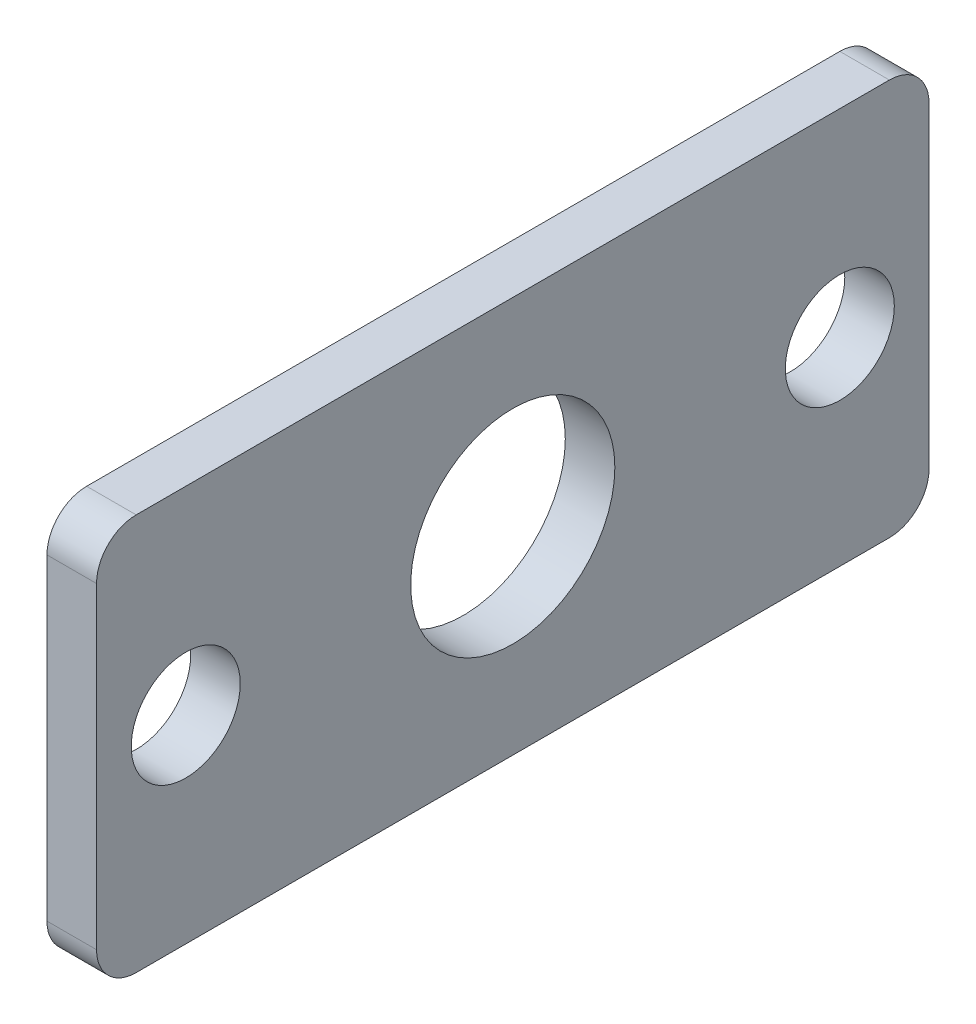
ISO-10303-21;
HEADER;
FILE_DESCRIPTION(('STEP AP214'),'2;1');
FILE_NAME('part.step','',(''),(''),'','','');
FILE_SCHEMA(('AUTOMOTIVE_DESIGN { 1 0 10303 214 1 1 1 1 }'));
ENDSEC;
DATA;
#1=APPLICATION_CONTEXT('core data for automotive mechanical design processes');
#2=APPLICATION_PROTOCOL_DEFINITION('international standard','automotive_design',2000,#1);
#3=PRODUCT_CONTEXT('',#1,'mechanical');
#4=PRODUCT('Part','Part','',(#3));
#5=PRODUCT_RELATED_PRODUCT_CATEGORY('part','',(#4));
#6=PRODUCT_DEFINITION_FORMATION('','',#4);
#7=PRODUCT_DEFINITION_CONTEXT('part definition',#1,'design');
#8=PRODUCT_DEFINITION('design','',#6,#7);
#9=PRODUCT_DEFINITION_SHAPE('','',#8);
#10=(LENGTH_UNIT() NAMED_UNIT(*) SI_UNIT(.MILLI.,.METRE.));
#11=(NAMED_UNIT(*) PLANE_ANGLE_UNIT() SI_UNIT($,.RADIAN.));
#12=(NAMED_UNIT(*) SI_UNIT($,.STERADIAN.) SOLID_ANGLE_UNIT());
#13=UNCERTAINTY_MEASURE_WITH_UNIT(LENGTH_MEASURE(1.E-05),#10,'distance_accuracy_value','');
#14=(GEOMETRIC_REPRESENTATION_CONTEXT(3) GLOBAL_UNCERTAINTY_ASSIGNED_CONTEXT((#13)) GLOBAL_UNIT_ASSIGNED_CONTEXT((#10,
#11,#12)) REPRESENTATION_CONTEXT('',''));
#15=CARTESIAN_POINT('',(0.,0.,0.));
#16=DIRECTION('',(0.,0.,1.));
#17=DIRECTION('',(1.,0.,0.));
#18=AXIS2_PLACEMENT_3D('',#15,#16,#17);
#19=CARTESIAN_POINT('',(2.5,1.99999999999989,-1.99999999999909));
#20=DIRECTION('',(1.,0.,0.));
#21=DIRECTION('',(0.,0.,-1.));
#22=AXIS2_PLACEMENT_3D('',#19,#20,#21);
#23=PLANE('',#22);
#24=CARTESIAN_POINT('',(2.5,9.99999999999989,-20.9999999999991));
#25=DIRECTION('',(1.,0.,0.));
#26=DIRECTION('',(0.,0.,-1.));
#27=AXIS2_PLACEMENT_3D('',#24,#25,#26);
#28=CIRCLE('',#27,5.15);
#29=CARTESIAN_POINT('',(2.5,9.99999999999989,-26.1499999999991));
#30=VERTEX_POINT('',#29);
#31=EDGE_CURVE('E190',#30,#30,#28,.T.);
#32=ORIENTED_EDGE('',*,*,#31,.F.);
#33=EDGE_LOOP('',(#32));
#34=FACE_BOUND('',#33,.T.);
#35=CARTESIAN_POINT('',(2.5,9.99999999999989,-37.4999999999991));
#36=DIRECTION('',(1.,0.,0.));
#37=DIRECTION('',(0.,0.,-1.));
#38=AXIS2_PLACEMENT_3D('',#35,#36,#37);
#39=CIRCLE('',#38,2.75);
#40=CARTESIAN_POINT('',(2.5,9.99999999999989,-40.2499999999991));
#41=VERTEX_POINT('',#40);
#42=EDGE_CURVE('E133',#41,#41,#39,.T.);
#43=ORIENTED_EDGE('',*,*,#42,.F.);
#44=EDGE_LOOP('',(#43));
#45=FACE_BOUND('',#44,.T.);
#46=CARTESIAN_POINT('',(2.5,1.99999999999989,-1.99999999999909));
#47=DIRECTION('',(1.,0.,0.));
#48=DIRECTION('',(0.,0.,-1.));
#49=AXIS2_PLACEMENT_3D('',#46,#47,#48);
#50=CIRCLE('',#49,2.);
#51=CARTESIAN_POINT('',(2.5,1.99999999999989,9.09494701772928E-13));
#52=VERTEX_POINT('',#51);
#53=CARTESIAN_POINT('',(2.5,-1.13686837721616E-13,-1.99999999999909));
#54=VERTEX_POINT('',#53);
#55=EDGE_CURVE('E144',#52,#54,#50,.T.);
#56=ORIENTED_EDGE('',*,*,#55,.T.);
#57=DIRECTION('',(0.,0.,-1.));
#58=VECTOR('',#57,1.);
#59=CARTESIAN_POINT('',(2.5,-1.13686837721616E-13,-1.99999999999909));
#60=LINE('',#59,#58);
#61=CARTESIAN_POINT('',(2.5,-1.14491749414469E-13,-39.9999999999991));
#62=VERTEX_POINT('',#61);
#63=EDGE_CURVE('E92',#54,#62,#60,.T.);
#64=ORIENTED_EDGE('',*,*,#63,.T.);
#65=CARTESIAN_POINT('',(2.5,1.99999999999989,-39.9999999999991));
#66=DIRECTION('',(1.,0.,0.));
#67=DIRECTION('',(0.,0.,-1.));
#68=AXIS2_PLACEMENT_3D('',#65,#66,#67);
#69=CIRCLE('',#68,2.);
#70=CARTESIAN_POINT('',(2.5,1.99999999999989,-41.9999999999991));
#71=VERTEX_POINT('',#70);
#72=EDGE_CURVE('E159',#62,#71,#69,.T.);
#73=ORIENTED_EDGE('',*,*,#72,.T.);
#74=DIRECTION('',(0.,1.,0.));
#75=VECTOR('',#74,1.);
#76=CARTESIAN_POINT('',(2.5,17.9999999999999,-41.9999999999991));
#77=LINE('',#76,#75);
#78=CARTESIAN_POINT('',(2.5,17.9999999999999,-41.9999999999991));
#79=VERTEX_POINT('',#78);
#80=EDGE_CURVE('E172',#71,#79,#77,.T.);
#81=ORIENTED_EDGE('',*,*,#80,.T.);
#82=CARTESIAN_POINT('',(2.5,17.9999999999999,-39.9999999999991));
#83=DIRECTION('',(1.,0.,0.));
#84=DIRECTION('',(0.,0.,-1.));
#85=AXIS2_PLACEMENT_3D('',#82,#83,#84);
#86=CIRCLE('',#85,2.);
#87=CARTESIAN_POINT('',(2.5,19.9999999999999,-39.9999999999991));
#88=VERTEX_POINT('',#87);
#89=EDGE_CURVE('E111',#79,#88,#86,.T.);
#90=ORIENTED_EDGE('',*,*,#89,.T.);
#91=DIRECTION('',(0.,0.,1.));
#92=VECTOR('',#91,1.);
#93=CARTESIAN_POINT('',(2.5,19.9999999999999,-1.99999999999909));
#94=LINE('',#93,#92);
#95=CARTESIAN_POINT('',(2.5,19.9999999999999,-1.99999999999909));
#96=VERTEX_POINT('',#95);
#97=EDGE_CURVE('E105',#88,#96,#94,.T.);
#98=ORIENTED_EDGE('',*,*,#97,.T.);
#99=CARTESIAN_POINT('',(2.5,17.9999999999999,-1.99999999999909));
#100=DIRECTION('',(1.,0.,0.));
#101=DIRECTION('',(0.,0.,-1.));
#102=AXIS2_PLACEMENT_3D('',#99,#100,#101);
#103=CIRCLE('',#102,2.);
#104=CARTESIAN_POINT('',(2.5,17.9999999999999,9.09494701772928E-13));
#105=VERTEX_POINT('',#104);
#106=EDGE_CURVE('E109',#96,#105,#103,.T.);
#107=ORIENTED_EDGE('',*,*,#106,.T.);
#108=DIRECTION('',(0.,-1.,0.));
#109=VECTOR('',#108,1.);
#110=CARTESIAN_POINT('',(2.5,17.9999999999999,9.09494701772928E-13));
#111=LINE('',#110,#109);
#112=EDGE_CURVE('E49',#105,#52,#111,.T.);
#113=ORIENTED_EDGE('',*,*,#112,.T.);
#114=EDGE_LOOP('',(#56,#64,#73,#81,#90,#98,#107,#113));
#115=FACE_BOUND('',#114,.T.);
#116=CARTESIAN_POINT('',(2.5,9.99999999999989,-4.49999999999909));
#117=DIRECTION('',(1.,0.,0.));
#118=DIRECTION('',(0.,0.,-1.));
#119=AXIS2_PLACEMENT_3D('',#116,#117,#118);
#120=CIRCLE('',#119,2.75);
#121=CARTESIAN_POINT('',(2.5,9.99999999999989,-7.24999999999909));
#122=VERTEX_POINT('',#121);
#123=EDGE_CURVE('E181',#122,#122,#120,.T.);
#124=ORIENTED_EDGE('',*,*,#123,.F.);
#125=EDGE_LOOP('',(#124));
#126=FACE_BOUND('',#125,.T.);
#127=ADVANCED_FACE('F32',(#34,#45,#115,#126),#23,.T.);
#128=CARTESIAN_POINT('',(0.,1.99999999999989,-1.99999999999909));
#129=DIRECTION('',(1.,0.,0.));
#130=DIRECTION('',(0.,0.,-1.));
#131=AXIS2_PLACEMENT_3D('',#128,#129,#130);
#132=PLANE('',#131);
#133=CARTESIAN_POINT('',(0.,9.99999999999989,-20.9999999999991));
#134=DIRECTION('',(1.,0.,0.));
#135=DIRECTION('',(0.,0.,-1.));
#136=AXIS2_PLACEMENT_3D('',#133,#134,#135);
#137=CIRCLE('',#136,5.15);
#138=CARTESIAN_POINT('',(0.,9.99999999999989,-26.1499999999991));
#139=VERTEX_POINT('',#138);
#140=EDGE_CURVE('E187',#139,#139,#137,.T.);
#141=ORIENTED_EDGE('',*,*,#140,.T.);
#142=EDGE_LOOP('',(#141));
#143=FACE_BOUND('',#142,.T.);
#144=CARTESIAN_POINT('',(0.,9.99999999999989,-37.4999999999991));
#145=DIRECTION('',(1.,0.,0.));
#146=DIRECTION('',(0.,0.,-1.));
#147=AXIS2_PLACEMENT_3D('',#144,#145,#146);
#148=CIRCLE('',#147,2.75);
#149=CARTESIAN_POINT('',(0.,9.99999999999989,-40.2499999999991));
#150=VERTEX_POINT('',#149);
#151=EDGE_CURVE('E178',#150,#150,#148,.T.);
#152=ORIENTED_EDGE('',*,*,#151,.T.);
#153=EDGE_LOOP('',(#152));
#154=FACE_BOUND('',#153,.T.);
#155=CARTESIAN_POINT('',(0.,1.99999999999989,-1.99999999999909));
#156=DIRECTION('',(1.,0.,0.));
#157=DIRECTION('',(0.,0.,-1.));
#158=AXIS2_PLACEMENT_3D('',#155,#156,#157);
#159=CIRCLE('',#158,2.);
#160=CARTESIAN_POINT('',(0.,1.99999999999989,9.09494701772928E-13));
#161=VERTEX_POINT('',#160);
#162=CARTESIAN_POINT('',(0.,-1.13686837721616E-13,-1.99999999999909));
#163=VERTEX_POINT('',#162);
#164=EDGE_CURVE('E129',#161,#163,#159,.T.);
#165=ORIENTED_EDGE('',*,*,#164,.F.);
#166=DIRECTION('',(0.,-1.,0.));
#167=VECTOR('',#166,1.);
#168=CARTESIAN_POINT('',(0.,17.9999999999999,9.09494701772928E-13));
#169=LINE('',#168,#167);
#170=CARTESIAN_POINT('',(0.,17.9999999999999,9.09494701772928E-13));
#171=VERTEX_POINT('',#170);
#172=EDGE_CURVE('E84',#171,#161,#169,.T.);
#173=ORIENTED_EDGE('',*,*,#172,.F.);
#174=CARTESIAN_POINT('',(0.,17.9999999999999,-1.99999999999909));
#175=DIRECTION('',(1.,0.,0.));
#176=DIRECTION('',(0.,0.,-1.));
#177=AXIS2_PLACEMENT_3D('',#174,#175,#176);
#178=CIRCLE('',#177,2.);
#179=CARTESIAN_POINT('',(0.,19.9999999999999,-1.99999999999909));
#180=VERTEX_POINT('',#179);
#181=EDGE_CURVE('E78',#180,#171,#178,.T.);
#182=ORIENTED_EDGE('',*,*,#181,.F.);
#183=DIRECTION('',(0.,0.,1.));
#184=VECTOR('',#183,1.);
#185=CARTESIAN_POINT('',(0.,19.9999999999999,-1.99999999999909));
#186=LINE('',#185,#184);
#187=CARTESIAN_POINT('',(0.,19.9999999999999,-39.9999999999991));
#188=VERTEX_POINT('',#187);
#189=EDGE_CURVE('E119',#188,#180,#186,.T.);
#190=ORIENTED_EDGE('',*,*,#189,.F.);
#191=CARTESIAN_POINT('',(0.,17.9999999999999,-39.9999999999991));
#192=DIRECTION('',(1.,0.,0.));
#193=DIRECTION('',(0.,0.,-1.));
#194=AXIS2_PLACEMENT_3D('',#191,#192,#193);
#195=CIRCLE('',#194,2.);
#196=CARTESIAN_POINT('',(0.,17.9999999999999,-41.9999999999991));
#197=VERTEX_POINT('',#196);
#198=EDGE_CURVE('E139',#197,#188,#195,.T.);
#199=ORIENTED_EDGE('',*,*,#198,.F.);
#200=DIRECTION('',(0.,1.,0.));
#201=VECTOR('',#200,1.);
#202=CARTESIAN_POINT('',(0.,17.9999999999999,-41.9999999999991));
#203=LINE('',#202,#201);
#204=CARTESIAN_POINT('',(0.,1.99999999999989,-41.9999999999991));
#205=VERTEX_POINT('',#204);
#206=EDGE_CURVE('E137',#205,#197,#203,.T.);
#207=ORIENTED_EDGE('',*,*,#206,.F.);
#208=CARTESIAN_POINT('',(0.,1.99999999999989,-39.9999999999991));
#209=DIRECTION('',(1.,0.,0.));
#210=DIRECTION('',(0.,0.,-1.));
#211=AXIS2_PLACEMENT_3D('',#208,#209,#210);
#212=CIRCLE('',#211,2.);
#213=CARTESIAN_POINT('',(0.,-1.14491749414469E-13,-39.9999999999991));
#214=VERTEX_POINT('',#213);
#215=EDGE_CURVE('E135',#214,#205,#212,.T.);
#216=ORIENTED_EDGE('',*,*,#215,.F.);
#217=DIRECTION('',(0.,0.,-1.));
#218=VECTOR('',#217,1.);
#219=CARTESIAN_POINT('',(0.,-1.13686837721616E-13,-1.99999999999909));
#220=LINE('',#219,#218);
#221=EDGE_CURVE('E132',#163,#214,#220,.T.);
#222=ORIENTED_EDGE('',*,*,#221,.F.);
#223=EDGE_LOOP('',(#165,#173,#182,#190,#199,#207,#216,#222));
#224=FACE_BOUND('',#223,.T.);
#225=CARTESIAN_POINT('',(0.,9.99999999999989,-4.49999999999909));
#226=DIRECTION('',(1.,0.,0.));
#227=DIRECTION('',(0.,0.,-1.));
#228=AXIS2_PLACEMENT_3D('',#225,#226,#227);
#229=CIRCLE('',#228,2.75);
#230=CARTESIAN_POINT('',(0.,9.99999999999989,-7.24999999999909));
#231=VERTEX_POINT('',#230);
#232=EDGE_CURVE('E184',#231,#231,#229,.T.);
#233=ORIENTED_EDGE('',*,*,#232,.T.);
#234=EDGE_LOOP('',(#233));
#235=FACE_BOUND('',#234,.T.);
#236=ADVANCED_FACE('F163',(#143,#154,#224,#235),#132,.F.);
#237=CARTESIAN_POINT('',(2.5,1.99999999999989,-1.99999999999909));
#238=DIRECTION('',(-1.,0.,0.));
#239=DIRECTION('',(0.,0.,1.));
#240=AXIS2_PLACEMENT_3D('',#237,#238,#239);
#241=CYLINDRICAL_SURFACE('',#240,2.);
#242=ORIENTED_EDGE('',*,*,#164,.T.);
#243=DIRECTION('',(-1.,0.,0.));
#244=VECTOR('',#243,1.);
#245=CARTESIAN_POINT('',(2.5,-1.13686837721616E-13,-1.99999999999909));
#246=LINE('',#245,#244);
#247=EDGE_CURVE('E11',#54,#163,#246,.T.);
#248=ORIENTED_EDGE('',*,*,#247,.F.);
#249=ORIENTED_EDGE('',*,*,#55,.F.);
#250=DIRECTION('',(-1.,0.,0.));
#251=VECTOR('',#250,1.);
#252=CARTESIAN_POINT('',(2.5,1.99999999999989,9.09494701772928E-13));
#253=LINE('',#252,#251);
#254=EDGE_CURVE('E125',#52,#161,#253,.T.);
#255=ORIENTED_EDGE('',*,*,#254,.T.);
#256=EDGE_LOOP('',(#242,#248,#249,#255));
#257=FACE_BOUND('',#256,.T.);
#258=ADVANCED_FACE('F34',(#257),#241,.T.);
#259=CARTESIAN_POINT('',(2.5,-1.13686837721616E-13,-1.99999999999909));
#260=DIRECTION('',(0.,1.,0.));
#261=DIRECTION('',(0.,0.,1.));
#262=AXIS2_PLACEMENT_3D('',#259,#260,#261);
#263=PLANE('',#262);
#264=ORIENTED_EDGE('',*,*,#221,.T.);
#265=DIRECTION('',(-1.,0.,0.));
#266=VECTOR('',#265,1.);
#267=CARTESIAN_POINT('',(2.5,-1.14491749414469E-13,-39.9999999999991));
#268=LINE('',#267,#266);
#269=EDGE_CURVE('E41',#62,#214,#268,.T.);
#270=ORIENTED_EDGE('',*,*,#269,.F.);
#271=ORIENTED_EDGE('',*,*,#63,.F.);
#272=ORIENTED_EDGE('',*,*,#247,.T.);
#273=EDGE_LOOP('',(#264,#270,#271,#272));
#274=FACE_BOUND('',#273,.T.);
#275=ADVANCED_FACE('F221',(#274),#263,.F.);
#276=CARTESIAN_POINT('',(2.5,1.99999999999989,-39.9999999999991));
#277=DIRECTION('',(-1.,0.,0.));
#278=DIRECTION('',(0.,0.,1.));
#279=AXIS2_PLACEMENT_3D('',#276,#277,#278);
#280=CYLINDRICAL_SURFACE('',#279,2.);
#281=ORIENTED_EDGE('',*,*,#215,.T.);
#282=DIRECTION('',(-1.,0.,0.));
#283=VECTOR('',#282,1.);
#284=CARTESIAN_POINT('',(2.5,1.99999999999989,-41.9999999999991));
#285=LINE('',#284,#283);
#286=EDGE_CURVE('E151',#71,#205,#285,.T.);
#287=ORIENTED_EDGE('',*,*,#286,.F.);
#288=ORIENTED_EDGE('',*,*,#72,.F.);
#289=ORIENTED_EDGE('',*,*,#269,.T.);
#290=EDGE_LOOP('',(#281,#287,#288,#289));
#291=FACE_BOUND('',#290,.T.);
#292=ADVANCED_FACE('F157',(#291),#280,.T.);
#293=CARTESIAN_POINT('',(2.5,17.9999999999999,-41.9999999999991));
#294=DIRECTION('',(0.,0.,1.));
#295=DIRECTION('',(1.,0.,0.));
#296=AXIS2_PLACEMENT_3D('',#293,#294,#295);
#297=PLANE('',#296);
#298=ORIENTED_EDGE('',*,*,#206,.T.);
#299=DIRECTION('',(-1.,0.,0.));
#300=VECTOR('',#299,1.);
#301=CARTESIAN_POINT('',(2.5,17.9999999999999,-41.9999999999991));
#302=LINE('',#301,#300);
#303=EDGE_CURVE('E148',#79,#197,#302,.T.);
#304=ORIENTED_EDGE('',*,*,#303,.F.);
#305=ORIENTED_EDGE('',*,*,#80,.F.);
#306=ORIENTED_EDGE('',*,*,#286,.T.);
#307=EDGE_LOOP('',(#298,#304,#305,#306));
#308=FACE_BOUND('',#307,.T.);
#309=ADVANCED_FACE('F168',(#308),#297,.F.);
#310=CARTESIAN_POINT('',(2.5,17.9999999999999,-39.9999999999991));
#311=DIRECTION('',(-1.,0.,0.));
#312=DIRECTION('',(0.,0.,1.));
#313=AXIS2_PLACEMENT_3D('',#310,#311,#312);
#314=CYLINDRICAL_SURFACE('',#313,2.);
#315=ORIENTED_EDGE('',*,*,#198,.T.);
#316=DIRECTION('',(-1.,0.,0.));
#317=VECTOR('',#316,1.);
#318=CARTESIAN_POINT('',(2.5,19.9999999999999,-39.9999999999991));
#319=LINE('',#318,#317);
#320=EDGE_CURVE('E120',#88,#188,#319,.T.);
#321=ORIENTED_EDGE('',*,*,#320,.F.);
#322=ORIENTED_EDGE('',*,*,#89,.F.);
#323=ORIENTED_EDGE('',*,*,#303,.T.);
#324=EDGE_LOOP('',(#315,#321,#322,#323));
#325=FACE_BOUND('',#324,.T.);
#326=ADVANCED_FACE('F171',(#325),#314,.T.);
#327=CARTESIAN_POINT('',(2.5,19.9999999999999,-1.99999999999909));
#328=DIRECTION('',(0.,-1.,0.));
#329=DIRECTION('',(0.,0.,-1.));
#330=AXIS2_PLACEMENT_3D('',#327,#328,#329);
#331=PLANE('',#330);
#332=ORIENTED_EDGE('',*,*,#189,.T.);
#333=DIRECTION('',(-1.,0.,0.));
#334=VECTOR('',#333,1.);
#335=CARTESIAN_POINT('',(2.5,19.9999999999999,-1.99999999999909));
#336=LINE('',#335,#334);
#337=EDGE_CURVE('E116',#96,#180,#336,.T.);
#338=ORIENTED_EDGE('',*,*,#337,.F.);
#339=ORIENTED_EDGE('',*,*,#97,.F.);
#340=ORIENTED_EDGE('',*,*,#320,.T.);
#341=EDGE_LOOP('',(#332,#338,#339,#340));
#342=FACE_BOUND('',#341,.T.);
#343=ADVANCED_FACE('F117',(#342),#331,.F.);
#344=CARTESIAN_POINT('',(2.5,17.9999999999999,-1.99999999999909));
#345=DIRECTION('',(-1.,0.,0.));
#346=DIRECTION('',(0.,0.,1.));
#347=AXIS2_PLACEMENT_3D('',#344,#345,#346);
#348=CYLINDRICAL_SURFACE('',#347,2.);
#349=ORIENTED_EDGE('',*,*,#181,.T.);
#350=DIRECTION('',(-1.,0.,0.));
#351=VECTOR('',#350,1.);
#352=CARTESIAN_POINT('',(2.5,17.9999999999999,9.09494701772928E-13));
#353=LINE('',#352,#351);
#354=EDGE_CURVE('E121',#105,#171,#353,.T.);
#355=ORIENTED_EDGE('',*,*,#354,.F.);
#356=ORIENTED_EDGE('',*,*,#106,.F.);
#357=ORIENTED_EDGE('',*,*,#337,.T.);
#358=EDGE_LOOP('',(#349,#355,#356,#357));
#359=FACE_BOUND('',#358,.T.);
#360=ADVANCED_FACE('F123',(#359),#348,.T.);
#361=CARTESIAN_POINT('',(2.5,17.9999999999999,9.09494701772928E-13));
#362=DIRECTION('',(0.,0.,-1.));
#363=DIRECTION('',(-1.,0.,0.));
#364=AXIS2_PLACEMENT_3D('',#361,#362,#363);
#365=PLANE('',#364);
#366=ORIENTED_EDGE('',*,*,#172,.T.);
#367=ORIENTED_EDGE('',*,*,#254,.F.);
#368=ORIENTED_EDGE('',*,*,#112,.F.);
#369=ORIENTED_EDGE('',*,*,#354,.T.);
#370=EDGE_LOOP('',(#366,#367,#368,#369));
#371=FACE_BOUND('',#370,.T.);
#372=ADVANCED_FACE('F213',(#371),#365,.F.);
#373=CARTESIAN_POINT('',(2.5,9.99999999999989,-37.4999999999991));
#374=DIRECTION('',(-1.,0.,0.));
#375=DIRECTION('',(0.,0.,1.));
#376=AXIS2_PLACEMENT_3D('',#373,#374,#375);
#377=CYLINDRICAL_SURFACE('',#376,2.75);
#378=ORIENTED_EDGE('',*,*,#42,.T.);
#379=EDGE_LOOP('',(#378));
#380=FACE_BOUND('',#379,.T.);
#381=ORIENTED_EDGE('',*,*,#151,.F.);
#382=EDGE_LOOP('',(#381));
#383=FACE_BOUND('',#382,.T.);
#384=ADVANCED_FACE('F210',(#380,#383),#377,.F.);
#385=CARTESIAN_POINT('',(2.5,9.99999999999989,-4.49999999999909));
#386=DIRECTION('',(-1.,0.,0.));
#387=DIRECTION('',(0.,0.,1.));
#388=AXIS2_PLACEMENT_3D('',#385,#386,#387);
#389=CYLINDRICAL_SURFACE('',#388,2.75);
#390=ORIENTED_EDGE('',*,*,#123,.T.);
#391=EDGE_LOOP('',(#390));
#392=FACE_BOUND('',#391,.T.);
#393=ORIENTED_EDGE('',*,*,#232,.F.);
#394=EDGE_LOOP('',(#393));
#395=FACE_BOUND('',#394,.T.);
#396=ADVANCED_FACE('F201',(#392,#395),#389,.F.);
#397=CARTESIAN_POINT('',(0.,9.99999999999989,-20.9999999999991));
#398=DIRECTION('',(1.,0.,0.));
#399=DIRECTION('',(0.,0.,-1.));
#400=AXIS2_PLACEMENT_3D('',#397,#398,#399);
#401=CYLINDRICAL_SURFACE('',#400,5.15);
#402=ORIENTED_EDGE('',*,*,#140,.F.);
#403=EDGE_LOOP('',(#402));
#404=FACE_BOUND('',#403,.T.);
#405=ORIENTED_EDGE('',*,*,#31,.T.);
#406=EDGE_LOOP('',(#405));
#407=FACE_BOUND('',#406,.T.);
#408=ADVANCED_FACE('F198',(#404,#407),#401,.F.);
#409=CLOSED_SHELL('',(#127,#236,#258,#275,#292,#309,#326,#343,#360,#372,#384,#396,#408));
#410=MANIFOLD_SOLID_BREP('B2',#409);
#411=ADVANCED_BREP_SHAPE_REPRESENTATION('',(#18,#410),#14);
#412=SHAPE_DEFINITION_REPRESENTATION(#9,#411);
ENDSEC;
END-ISO-10303-21;
